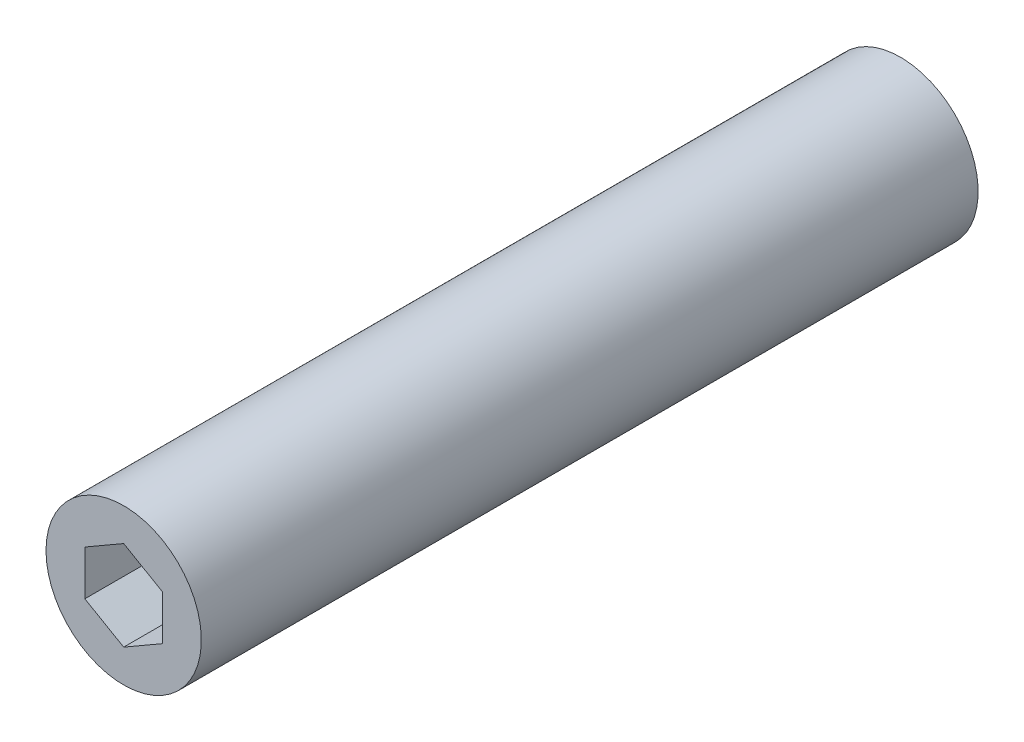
ISO-10303-21;
HEADER;
FILE_DESCRIPTION(('STEP AP214'),'2;1');
FILE_NAME('part.step','',(''),(''),'','','');
FILE_SCHEMA(('AUTOMOTIVE_DESIGN { 1 0 10303 214 1 1 1 1 }'));
ENDSEC;
DATA;
#1=APPLICATION_CONTEXT('core data for automotive mechanical design processes');
#2=APPLICATION_PROTOCOL_DEFINITION('international standard','automotive_design',2000,#1);
#3=PRODUCT_CONTEXT('',#1,'mechanical');
#4=PRODUCT('Part','Part','',(#3));
#5=PRODUCT_RELATED_PRODUCT_CATEGORY('part','',(#4));
#6=PRODUCT_DEFINITION_FORMATION('','',#4);
#7=PRODUCT_DEFINITION_CONTEXT('part definition',#1,'design');
#8=PRODUCT_DEFINITION('design','',#6,#7);
#9=PRODUCT_DEFINITION_SHAPE('','',#8);
#10=(LENGTH_UNIT() NAMED_UNIT(*) SI_UNIT(.MILLI.,.METRE.));
#11=(NAMED_UNIT(*) PLANE_ANGLE_UNIT() SI_UNIT($,.RADIAN.));
#12=(NAMED_UNIT(*) SI_UNIT($,.STERADIAN.) SOLID_ANGLE_UNIT());
#13=UNCERTAINTY_MEASURE_WITH_UNIT(LENGTH_MEASURE(1.E-05),#10,'distance_accuracy_value','');
#14=(GEOMETRIC_REPRESENTATION_CONTEXT(3) GLOBAL_UNCERTAINTY_ASSIGNED_CONTEXT((#13)) GLOBAL_UNIT_ASSIGNED_CONTEXT((#10,
#11,#12)) REPRESENTATION_CONTEXT('',''));
#15=CARTESIAN_POINT('',(0.,0.,0.));
#16=DIRECTION('',(0.,0.,1.));
#17=DIRECTION('',(1.,0.,0.));
#18=AXIS2_PLACEMENT_3D('',#15,#16,#17);
#19=CARTESIAN_POINT('',(0.,0.,60.));
#20=DIRECTION('',(0.,0.,-1.));
#21=DIRECTION('',(-1.,0.,0.));
#22=AXIS2_PLACEMENT_3D('',#19,#20,#21);
#23=CYLINDRICAL_SURFACE('',#22,6.);
#24=CARTESIAN_POINT('',(0.,0.,60.));
#25=DIRECTION('',(0.,0.,-1.));
#26=DIRECTION('',(-1.,0.,0.));
#27=AXIS2_PLACEMENT_3D('',#24,#25,#26);
#28=CIRCLE('',#27,6.);
#29=CARTESIAN_POINT('',(-6.,0.,60.));
#30=VERTEX_POINT('',#29);
#31=EDGE_CURVE('E9',#30,#30,#28,.T.);
#32=ORIENTED_EDGE('',*,*,#31,.T.);
#33=EDGE_LOOP('',(#32));
#34=FACE_BOUND('',#33,.T.);
#35=CARTESIAN_POINT('',(0.,0.,0.));
#36=DIRECTION('',(0.,0.,-1.));
#37=DIRECTION('',(-1.,0.,0.));
#38=AXIS2_PLACEMENT_3D('',#35,#36,#37);
#39=CIRCLE('',#38,6.);
#40=CARTESIAN_POINT('',(-6.,0.,0.));
#41=VERTEX_POINT('',#40);
#42=EDGE_CURVE('E21',#41,#41,#39,.T.);
#43=ORIENTED_EDGE('',*,*,#42,.F.);
#44=EDGE_LOOP('',(#43));
#45=FACE_BOUND('',#44,.T.);
#46=ADVANCED_FACE('F14',(#34,#45),#23,.T.);
#47=CARTESIAN_POINT('',(0.,0.,60.));
#48=DIRECTION('',(0.,0.,-1.));
#49=DIRECTION('',(-1.,0.,0.));
#50=AXIS2_PLACEMENT_3D('',#47,#48,#49);
#51=PLANE('',#50);
#52=DIRECTION('',(-0.866025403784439,-0.5,0.));
#53=VECTOR('',#52,1.);
#54=CARTESIAN_POINT('',(0.,3.46410161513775,60.));
#55=LINE('',#54,#53);
#56=CARTESIAN_POINT('',(0.,3.46410161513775,60.));
#57=VERTEX_POINT('',#56);
#58=CARTESIAN_POINT('',(-3.,1.73205080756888,60.));
#59=VERTEX_POINT('',#58);
#60=EDGE_CURVE('E82',#57,#59,#55,.T.);
#61=ORIENTED_EDGE('',*,*,#60,.F.);
#62=DIRECTION('',(-0.866025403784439,0.5,0.));
#63=VECTOR('',#62,1.);
#64=CARTESIAN_POINT('',(3.,1.73205080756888,60.));
#65=LINE('',#64,#63);
#66=CARTESIAN_POINT('',(3.,1.73205080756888,60.));
#67=VERTEX_POINT('',#66);
#68=EDGE_CURVE('E28',#67,#57,#65,.T.);
#69=ORIENTED_EDGE('',*,*,#68,.F.);
#70=DIRECTION('',(0.,1.,0.));
#71=VECTOR('',#70,1.);
#72=CARTESIAN_POINT('',(3.,-1.73205080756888,60.));
#73=LINE('',#72,#71);
#74=CARTESIAN_POINT('',(3.,-1.73205080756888,60.));
#75=VERTEX_POINT('',#74);
#76=EDGE_CURVE('E98',#75,#67,#73,.T.);
#77=ORIENTED_EDGE('',*,*,#76,.F.);
#78=DIRECTION('',(0.866025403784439,0.5,0.));
#79=VECTOR('',#78,1.);
#80=CARTESIAN_POINT('',(0.,-3.46410161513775,60.));
#81=LINE('',#80,#79);
#82=CARTESIAN_POINT('',(0.,-3.46410161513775,60.));
#83=VERTEX_POINT('',#82);
#84=EDGE_CURVE('E92',#83,#75,#81,.T.);
#85=ORIENTED_EDGE('',*,*,#84,.F.);
#86=DIRECTION('',(0.866025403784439,-0.5,0.));
#87=VECTOR('',#86,1.);
#88=CARTESIAN_POINT('',(-3.,-1.73205080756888,60.));
#89=LINE('',#88,#87);
#90=CARTESIAN_POINT('',(-3.,-1.73205080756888,60.));
#91=VERTEX_POINT('',#90);
#92=EDGE_CURVE('E90',#91,#83,#89,.T.);
#93=ORIENTED_EDGE('',*,*,#92,.F.);
#94=DIRECTION('',(0.,-1.,0.));
#95=VECTOR('',#94,1.);
#96=CARTESIAN_POINT('',(-3.,1.73205080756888,60.));
#97=LINE('',#96,#95);
#98=EDGE_CURVE('E71',#59,#91,#97,.T.);
#99=ORIENTED_EDGE('',*,*,#98,.F.);
#100=EDGE_LOOP('',(#61,#69,#77,#85,#93,#99));
#101=FACE_BOUND('',#100,.T.);
#102=ORIENTED_EDGE('',*,*,#31,.F.);
#103=EDGE_LOOP('',(#102));
#104=FACE_BOUND('',#103,.T.);
#105=ADVANCED_FACE('F86',(#101,#104),#51,.F.);
#106=CARTESIAN_POINT('',(0.,0.,0.));
#107=DIRECTION('',(0.,0.,-1.));
#108=DIRECTION('',(-1.,0.,0.));
#109=AXIS2_PLACEMENT_3D('',#106,#107,#108);
#110=PLANE('',#109);
#111=ORIENTED_EDGE('',*,*,#42,.T.);
#112=EDGE_LOOP('',(#111));
#113=FACE_BOUND('',#112,.T.);
#114=ADVANCED_FACE('F124',(#113),#110,.T.);
#115=CARTESIAN_POINT('',(3.,1.73205080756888,55.));
#116=DIRECTION('',(0.5,0.866025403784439,0.));
#117=DIRECTION('',(0.866025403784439,-0.5,0.));
#118=AXIS2_PLACEMENT_3D('',#115,#116,#117);
#119=PLANE('',#118);
#120=ORIENTED_EDGE('',*,*,#68,.T.);
#121=DIRECTION('',(0.,0.,1.));
#122=VECTOR('',#121,1.);
#123=CARTESIAN_POINT('',(0.,3.46410161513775,55.));
#124=LINE('',#123,#122);
#125=CARTESIAN_POINT('',(0.,3.46410161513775,55.));
#126=VERTEX_POINT('',#125);
#127=EDGE_CURVE('E79',#126,#57,#124,.T.);
#128=ORIENTED_EDGE('',*,*,#127,.F.);
#129=DIRECTION('',(-0.866025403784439,0.5,0.));
#130=VECTOR('',#129,1.);
#131=CARTESIAN_POINT('',(3.,1.73205080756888,55.));
#132=LINE('',#131,#130);
#133=CARTESIAN_POINT('',(3.,1.73205080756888,55.));
#134=VERTEX_POINT('',#133);
#135=EDGE_CURVE('E100',#134,#126,#132,.T.);
#136=ORIENTED_EDGE('',*,*,#135,.F.);
#137=DIRECTION('',(0.,0.,1.));
#138=VECTOR('',#137,1.);
#139=CARTESIAN_POINT('',(3.,1.73205080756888,55.));
#140=LINE('',#139,#138);
#141=EDGE_CURVE('E35',#134,#67,#140,.T.);
#142=ORIENTED_EDGE('',*,*,#141,.T.);
#143=EDGE_LOOP('',(#120,#128,#136,#142));
#144=FACE_BOUND('',#143,.T.);
#145=ADVANCED_FACE('F138',(#144),#119,.F.);
#146=CARTESIAN_POINT('',(3.,-1.73205080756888,55.));
#147=DIRECTION('',(1.,0.,0.));
#148=DIRECTION('',(0.,0.,-1.));
#149=AXIS2_PLACEMENT_3D('',#146,#147,#148);
#150=PLANE('',#149);
#151=ORIENTED_EDGE('',*,*,#76,.T.);
#152=ORIENTED_EDGE('',*,*,#141,.F.);
#153=DIRECTION('',(0.,1.,0.));
#154=VECTOR('',#153,1.);
#155=CARTESIAN_POINT('',(3.,-1.73205080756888,55.));
#156=LINE('',#155,#154);
#157=CARTESIAN_POINT('',(3.,-1.73205080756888,55.));
#158=VERTEX_POINT('',#157);
#159=EDGE_CURVE('E112',#158,#134,#156,.T.);
#160=ORIENTED_EDGE('',*,*,#159,.F.);
#161=DIRECTION('',(0.,0.,1.));
#162=VECTOR('',#161,1.);
#163=CARTESIAN_POINT('',(3.,-1.73205080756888,55.));
#164=LINE('',#163,#162);
#165=EDGE_CURVE('E116',#158,#75,#164,.T.);
#166=ORIENTED_EDGE('',*,*,#165,.T.);
#167=EDGE_LOOP('',(#151,#152,#160,#166));
#168=FACE_BOUND('',#167,.T.);
#169=ADVANCED_FACE('F143',(#168),#150,.F.);
#170=CARTESIAN_POINT('',(0.,-3.46410161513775,55.));
#171=DIRECTION('',(0.5,-0.866025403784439,0.));
#172=DIRECTION('',(-0.866025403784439,-0.5,0.));
#173=AXIS2_PLACEMENT_3D('',#170,#171,#172);
#174=PLANE('',#173);
#175=ORIENTED_EDGE('',*,*,#84,.T.);
#176=ORIENTED_EDGE('',*,*,#165,.F.);
#177=DIRECTION('',(0.866025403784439,0.5,0.));
#178=VECTOR('',#177,1.);
#179=CARTESIAN_POINT('',(0.,-3.46410161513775,55.));
#180=LINE('',#179,#178);
#181=CARTESIAN_POINT('',(0.,-3.46410161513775,55.));
#182=VERTEX_POINT('',#181);
#183=EDGE_CURVE('E109',#182,#158,#180,.T.);
#184=ORIENTED_EDGE('',*,*,#183,.F.);
#185=DIRECTION('',(0.,0.,1.));
#186=VECTOR('',#185,1.);
#187=CARTESIAN_POINT('',(0.,-3.46410161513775,55.));
#188=LINE('',#187,#186);
#189=EDGE_CURVE('E118',#182,#83,#188,.T.);
#190=ORIENTED_EDGE('',*,*,#189,.T.);
#191=EDGE_LOOP('',(#175,#176,#184,#190));
#192=FACE_BOUND('',#191,.T.);
#193=ADVANCED_FACE('F152',(#192),#174,.F.);
#194=CARTESIAN_POINT('',(-3.,-1.73205080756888,55.));
#195=DIRECTION('',(-0.5,-0.866025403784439,0.));
#196=DIRECTION('',(-0.866025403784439,0.5,0.));
#197=AXIS2_PLACEMENT_3D('',#194,#195,#196);
#198=PLANE('',#197);
#199=ORIENTED_EDGE('',*,*,#92,.T.);
#200=ORIENTED_EDGE('',*,*,#189,.F.);
#201=DIRECTION('',(0.866025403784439,-0.5,0.));
#202=VECTOR('',#201,1.);
#203=CARTESIAN_POINT('',(-3.,-1.73205080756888,55.));
#204=LINE('',#203,#202);
#205=CARTESIAN_POINT('',(-3.,-1.73205080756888,55.));
#206=VERTEX_POINT('',#205);
#207=EDGE_CURVE('E106',#206,#182,#204,.T.);
#208=ORIENTED_EDGE('',*,*,#207,.F.);
#209=DIRECTION('',(0.,0.,1.));
#210=VECTOR('',#209,1.);
#211=CARTESIAN_POINT('',(-3.,-1.73205080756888,55.));
#212=LINE('',#211,#210);
#213=EDGE_CURVE('E78',#206,#91,#212,.T.);
#214=ORIENTED_EDGE('',*,*,#213,.T.);
#215=EDGE_LOOP('',(#199,#200,#208,#214));
#216=FACE_BOUND('',#215,.T.);
#217=ADVANCED_FACE('F149',(#216),#198,.F.);
#218=CARTESIAN_POINT('',(-3.,1.73205080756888,55.));
#219=DIRECTION('',(-1.,0.,0.));
#220=DIRECTION('',(0.,0.,1.));
#221=AXIS2_PLACEMENT_3D('',#218,#219,#220);
#222=PLANE('',#221);
#223=ORIENTED_EDGE('',*,*,#98,.T.);
#224=ORIENTED_EDGE('',*,*,#213,.F.);
#225=DIRECTION('',(0.,-1.,0.));
#226=VECTOR('',#225,1.);
#227=CARTESIAN_POINT('',(-3.,1.73205080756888,55.));
#228=LINE('',#227,#226);
#229=CARTESIAN_POINT('',(-3.,1.73205080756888,55.));
#230=VERTEX_POINT('',#229);
#231=EDGE_CURVE('E74',#230,#206,#228,.T.);
#232=ORIENTED_EDGE('',*,*,#231,.F.);
#233=DIRECTION('',(0.,0.,1.));
#234=VECTOR('',#233,1.);
#235=CARTESIAN_POINT('',(-3.,1.73205080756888,55.));
#236=LINE('',#235,#234);
#237=EDGE_CURVE('E67',#230,#59,#236,.T.);
#238=ORIENTED_EDGE('',*,*,#237,.T.);
#239=EDGE_LOOP('',(#223,#224,#232,#238));
#240=FACE_BOUND('',#239,.T.);
#241=ADVANCED_FACE('F69',(#240),#222,.F.);
#242=CARTESIAN_POINT('',(0.,3.46410161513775,55.));
#243=DIRECTION('',(-0.5,0.866025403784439,0.));
#244=DIRECTION('',(0.866025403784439,0.5,0.));
#245=AXIS2_PLACEMENT_3D('',#242,#243,#244);
#246=PLANE('',#245);
#247=ORIENTED_EDGE('',*,*,#60,.T.);
#248=ORIENTED_EDGE('',*,*,#237,.F.);
#249=DIRECTION('',(-0.866025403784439,-0.5,0.));
#250=VECTOR('',#249,1.);
#251=CARTESIAN_POINT('',(0.,3.46410161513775,55.));
#252=LINE('',#251,#250);
#253=EDGE_CURVE('E103',#126,#230,#252,.T.);
#254=ORIENTED_EDGE('',*,*,#253,.F.);
#255=ORIENTED_EDGE('',*,*,#127,.T.);
#256=EDGE_LOOP('',(#247,#248,#254,#255));
#257=FACE_BOUND('',#256,.T.);
#258=ADVANCED_FACE('F83',(#257),#246,.F.);
#259=CARTESIAN_POINT('',(-3.,5.19615242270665,55.));
#260=DIRECTION('',(0.,0.,1.));
#261=DIRECTION('',(1.,0.,0.));
#262=AXIS2_PLACEMENT_3D('',#259,#260,#261);
#263=PLANE('',#262);
#264=ORIENTED_EDGE('',*,*,#135,.T.);
#265=ORIENTED_EDGE('',*,*,#253,.T.);
#266=ORIENTED_EDGE('',*,*,#231,.T.);
#267=ORIENTED_EDGE('',*,*,#207,.T.);
#268=ORIENTED_EDGE('',*,*,#183,.T.);
#269=ORIENTED_EDGE('',*,*,#159,.T.);
#270=EDGE_LOOP('',(#264,#265,#266,#267,#268,#269));
#271=FACE_BOUND('',#270,.T.);
#272=ADVANCED_FACE('F146',(#271),#263,.T.);
#273=CLOSED_SHELL('',(#46,#105,#114,#145,#169,#193,#217,#241,#258,#272));
#274=MANIFOLD_SOLID_BREP('B1',#273);
#275=ADVANCED_BREP_SHAPE_REPRESENTATION('',(#18,#274),#14);
#276=SHAPE_DEFINITION_REPRESENTATION(#9,#275);
ENDSEC;
END-ISO-10303-21;
